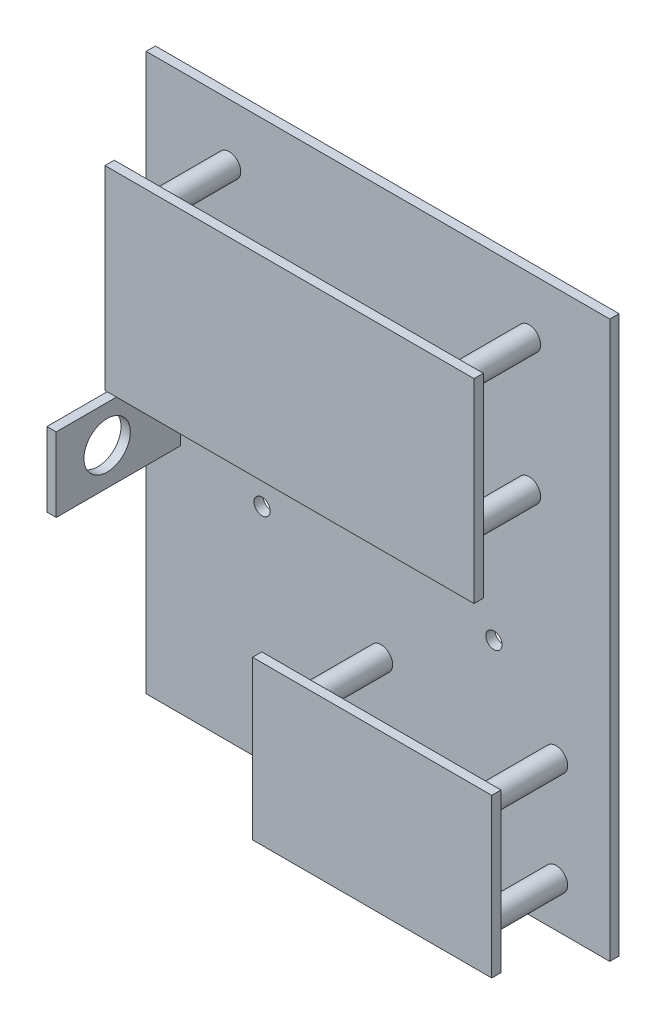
ISO-10303-21;
HEADER;
FILE_DESCRIPTION(('STEP AP214'),'2;1');
FILE_NAME('part.step','',(''),(''),'','','');
FILE_SCHEMA(('AUTOMOTIVE_DESIGN { 1 0 10303 214 1 1 1 1 }'));
ENDSEC;
DATA;
#1=APPLICATION_CONTEXT('core data for automotive mechanical design processes');
#2=APPLICATION_PROTOCOL_DEFINITION('international standard','automotive_design',2000,#1);
#3=PRODUCT_CONTEXT('',#1,'mechanical');
#4=PRODUCT('Part','Part','',(#3));
#5=PRODUCT_RELATED_PRODUCT_CATEGORY('part','',(#4));
#6=PRODUCT_DEFINITION_FORMATION('','',#4);
#7=PRODUCT_DEFINITION_CONTEXT('part definition',#1,'design');
#8=PRODUCT_DEFINITION('design','',#6,#7);
#9=PRODUCT_DEFINITION_SHAPE('','',#8);
#10=(LENGTH_UNIT() NAMED_UNIT(*) SI_UNIT(.MILLI.,.METRE.));
#11=(NAMED_UNIT(*) PLANE_ANGLE_UNIT() SI_UNIT($,.RADIAN.));
#12=(NAMED_UNIT(*) SI_UNIT($,.STERADIAN.) SOLID_ANGLE_UNIT());
#13=UNCERTAINTY_MEASURE_WITH_UNIT(LENGTH_MEASURE(1.E-05),#10,'distance_accuracy_value','');
#14=(GEOMETRIC_REPRESENTATION_CONTEXT(3) GLOBAL_UNCERTAINTY_ASSIGNED_CONTEXT((#13)) GLOBAL_UNIT_ASSIGNED_CONTEXT((#10,
#11,#12)) REPRESENTATION_CONTEXT('',''));
#15=CARTESIAN_POINT('',(0.,0.,0.));
#16=DIRECTION('',(0.,0.,1.));
#17=DIRECTION('',(1.,0.,0.));
#18=AXIS2_PLACEMENT_3D('',#15,#16,#17);
#19=CARTESIAN_POINT('',(0.,120.,2.));
#20=DIRECTION('',(0.,0.,-1.));
#21=DIRECTION('',(-1.,0.,0.));
#22=AXIS2_PLACEMENT_3D('',#19,#20,#21);
#23=PLANE('',#22);
#24=CARTESIAN_POINT('',(25.,72.5,2.));
#25=DIRECTION('',(0.,0.,-1.));
#26=DIRECTION('',(-1.,0.,0.));
#27=AXIS2_PLACEMENT_3D('',#24,#25,#26);
#28=CIRCLE('',#27,1.75);
#29=CARTESIAN_POINT('',(23.25,72.5,2.));
#30=VERTEX_POINT('',#29);
#31=EDGE_CURVE('E811',#30,#30,#28,.T.);
#32=ORIENTED_EDGE('',*,*,#31,.T.);
#33=EDGE_LOOP('',(#32));
#34=FACE_BOUND('',#33,.T.);
#35=CARTESIAN_POINT('',(25.,47.5,2.));
#36=DIRECTION('',(0.,0.,-1.));
#37=DIRECTION('',(-1.,0.,0.));
#38=AXIS2_PLACEMENT_3D('',#35,#36,#37);
#39=CIRCLE('',#38,1.75);
#40=CARTESIAN_POINT('',(23.25,47.5,2.));
#41=VERTEX_POINT('',#40);
#42=EDGE_CURVE('E805',#41,#41,#39,.T.);
#43=ORIENTED_EDGE('',*,*,#42,.T.);
#44=EDGE_LOOP('',(#43));
#45=FACE_BOUND('',#44,.T.);
#46=CARTESIAN_POINT('',(75.,47.5,2.));
#47=DIRECTION('',(0.,0.,-1.));
#48=DIRECTION('',(-1.,0.,0.));
#49=AXIS2_PLACEMENT_3D('',#46,#47,#48);
#50=CIRCLE('',#49,1.75);
#51=CARTESIAN_POINT('',(73.25,47.5,2.));
#52=VERTEX_POINT('',#51);
#53=EDGE_CURVE('E799',#52,#52,#50,.T.);
#54=ORIENTED_EDGE('',*,*,#53,.T.);
#55=EDGE_LOOP('',(#54));
#56=FACE_BOUND('',#55,.T.);
#57=CARTESIAN_POINT('',(75.,72.5,2.));
#58=DIRECTION('',(0.,0.,-1.));
#59=DIRECTION('',(-1.,0.,0.));
#60=AXIS2_PLACEMENT_3D('',#57,#58,#59);
#61=CIRCLE('',#60,1.75);
#62=CARTESIAN_POINT('',(73.25,72.5,2.));
#63=VERTEX_POINT('',#62);
#64=EDGE_CURVE('E791',#63,#63,#61,.T.);
#65=ORIENTED_EDGE('',*,*,#64,.T.);
#66=EDGE_LOOP('',(#65));
#67=FACE_BOUND('',#66,.T.);
#68=DIRECTION('',(0.,-1.,0.));
#69=VECTOR('',#68,1.);
#70=CARTESIAN_POINT('',(0.279042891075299,66.,2.));
#71=LINE('',#70,#69);
#72=CARTESIAN_POINT('',(0.279042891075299,66.,2.));
#73=VERTEX_POINT('',#72);
#74=CARTESIAN_POINT('',(0.279042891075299,50.,2.));
#75=VERTEX_POINT('',#74);
#76=EDGE_CURVE('E54',#73,#75,#71,.T.);
#77=ORIENTED_EDGE('',*,*,#76,.F.);
#78=DIRECTION('',(1.,0.,0.));
#79=VECTOR('',#78,1.);
#80=CARTESIAN_POINT('',(0.279042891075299,66.,2.));
#81=LINE('',#80,#79);
#82=CARTESIAN_POINT('',(7.37780242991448,66.,2.));
#83=VERTEX_POINT('',#82);
#84=EDGE_CURVE('E49',#73,#83,#81,.T.);
#85=ORIENTED_EDGE('',*,*,#84,.T.);
#86=DIRECTION('',(0.,-1.,0.));
#87=VECTOR('',#86,1.);
#88=CARTESIAN_POINT('',(7.37780242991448,66.,2.));
#89=LINE('',#88,#87);
#90=CARTESIAN_POINT('',(7.37780242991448,50.,2.));
#91=VERTEX_POINT('',#90);
#92=EDGE_CURVE('E212',#83,#91,#89,.T.);
#93=ORIENTED_EDGE('',*,*,#92,.T.);
#94=DIRECTION('',(1.,0.,0.));
#95=VECTOR('',#94,1.);
#96=CARTESIAN_POINT('',(0.279042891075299,50.,2.));
#97=LINE('',#96,#95);
#98=EDGE_CURVE('E201',#75,#91,#97,.T.);
#99=ORIENTED_EDGE('',*,*,#98,.F.);
#100=EDGE_LOOP('',(#77,#85,#93,#99));
#101=FACE_BOUND('',#100,.T.);
#102=CARTESIAN_POINT('',(88.4189618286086,9.65936561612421,2.));
#103=DIRECTION('',(0.,0.,-1.));
#104=DIRECTION('',(-1.,0.,0.));
#105=AXIS2_PLACEMENT_3D('',#102,#103,#104);
#106=CIRCLE('',#105,2.5);
#107=CARTESIAN_POINT('',(85.9189618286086,9.65936561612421,2.));
#108=VERTEX_POINT('',#107);
#109=EDGE_CURVE('E42',#108,#108,#106,.F.);
#110=ORIENTED_EDGE('',*,*,#109,.F.);
#111=EDGE_LOOP('',(#110));
#112=FACE_BOUND('',#111,.T.);
#113=CARTESIAN_POINT('',(50.6658867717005,31.9991419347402,2.));
#114=DIRECTION('',(0.,0.,-1.));
#115=DIRECTION('',(-1.,0.,0.));
#116=AXIS2_PLACEMENT_3D('',#113,#114,#115);
#117=CIRCLE('',#116,2.5);
#118=CARTESIAN_POINT('',(48.1658867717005,31.9991419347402,2.));
#119=VERTEX_POINT('',#118);
#120=EDGE_CURVE('E340',#119,#119,#117,.F.);
#121=ORIENTED_EDGE('',*,*,#120,.F.);
#122=EDGE_LOOP('',(#121));
#123=FACE_BOUND('',#122,.T.);
#124=CARTESIAN_POINT('',(82.58484265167,79.3503576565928,2.));
#125=DIRECTION('',(0.,0.,-1.));
#126=DIRECTION('',(-1.,0.,0.));
#127=AXIS2_PLACEMENT_3D('',#124,#125,#126);
#128=CIRCLE('',#127,2.5);
#129=CARTESIAN_POINT('',(80.08484265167,79.3503576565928,2.));
#130=VERTEX_POINT('',#129);
#131=EDGE_CURVE('E334',#130,#130,#128,.F.);
#132=ORIENTED_EDGE('',*,*,#131,.F.);
#133=EDGE_LOOP('',(#132));
#134=FACE_BOUND('',#133,.T.);
#135=CARTESIAN_POINT('',(17.9038666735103,107.720533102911,2.));
#136=DIRECTION('',(0.,0.,-1.));
#137=DIRECTION('',(-1.,0.,0.));
#138=AXIS2_PLACEMENT_3D('',#135,#136,#137);
#139=CIRCLE('',#138,2.5);
#140=CARTESIAN_POINT('',(15.4038666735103,107.720533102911,2.));
#141=VERTEX_POINT('',#140);
#142=EDGE_CURVE('E328',#141,#141,#139,.F.);
#143=ORIENTED_EDGE('',*,*,#142,.F.);
#144=EDGE_LOOP('',(#143));
#145=FACE_BOUND('',#144,.T.);
#146=DIRECTION('',(0.,-1.,0.));
#147=VECTOR('',#146,1.);
#148=CARTESIAN_POINT('',(0.,0.,2.));
#149=LINE('',#148,#147);
#150=CARTESIAN_POINT('',(0.,120.,2.));
#151=VERTEX_POINT('',#150);
#152=CARTESIAN_POINT('',(0.,0.,2.));
#153=VERTEX_POINT('',#152);
#154=EDGE_CURVE('E299',#151,#153,#149,.T.);
#155=ORIENTED_EDGE('',*,*,#154,.T.);
#156=DIRECTION('',(1.,0.,0.));
#157=VECTOR('',#156,1.);
#158=CARTESIAN_POINT('',(0.,0.,2.));
#159=LINE('',#158,#157);
#160=CARTESIAN_POINT('',(100.,0.,2.));
#161=VERTEX_POINT('',#160);
#162=EDGE_CURVE('E302',#153,#161,#159,.T.);
#163=ORIENTED_EDGE('',*,*,#162,.T.);
#164=DIRECTION('',(0.,1.,0.));
#165=VECTOR('',#164,1.);
#166=CARTESIAN_POINT('',(100.,0.,2.));
#167=LINE('',#166,#165);
#168=CARTESIAN_POINT('',(100.,120.,2.));
#169=VERTEX_POINT('',#168);
#170=EDGE_CURVE('E305',#161,#169,#167,.T.);
#171=ORIENTED_EDGE('',*,*,#170,.T.);
#172=DIRECTION('',(-1.,0.,0.));
#173=VECTOR('',#172,1.);
#174=CARTESIAN_POINT('',(0.,120.,2.));
#175=LINE('',#174,#173);
#176=EDGE_CURVE('E307',#169,#151,#175,.T.);
#177=ORIENTED_EDGE('',*,*,#176,.T.);
#178=EDGE_LOOP('',(#155,#163,#171,#177));
#179=FACE_BOUND('',#178,.T.);
#180=CARTESIAN_POINT('',(82.58484265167,107.720533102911,2.));
#181=DIRECTION('',(0.,0.,-1.));
#182=DIRECTION('',(-1.,0.,0.));
#183=AXIS2_PLACEMENT_3D('',#180,#181,#182);
#184=CIRCLE('',#183,2.5);
#185=CARTESIAN_POINT('',(80.08484265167,107.720533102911,2.));
#186=VERTEX_POINT('',#185);
#187=EDGE_CURVE('E331',#186,#186,#184,.F.);
#188=ORIENTED_EDGE('',*,*,#187,.F.);
#189=EDGE_LOOP('',(#188));
#190=FACE_BOUND('',#189,.T.);
#191=CARTESIAN_POINT('',(17.9038666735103,79.3503576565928,2.));
#192=DIRECTION('',(0.,0.,-1.));
#193=DIRECTION('',(-1.,0.,0.));
#194=AXIS2_PLACEMENT_3D('',#191,#192,#193);
#195=CIRCLE('',#194,2.5);
#196=CARTESIAN_POINT('',(15.4038666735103,79.3503576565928,2.));
#197=VERTEX_POINT('',#196);
#198=EDGE_CURVE('E337',#197,#197,#195,.F.);
#199=ORIENTED_EDGE('',*,*,#198,.F.);
#200=EDGE_LOOP('',(#199));
#201=FACE_BOUND('',#200,.T.);
#202=CARTESIAN_POINT('',(88.4189618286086,31.9991419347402,2.));
#203=DIRECTION('',(0.,0.,-1.));
#204=DIRECTION('',(-1.,0.,0.));
#205=AXIS2_PLACEMENT_3D('',#202,#203,#204);
#206=CIRCLE('',#205,2.5);
#207=CARTESIAN_POINT('',(85.9189618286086,31.9991419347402,2.));
#208=VERTEX_POINT('',#207);
#209=EDGE_CURVE('E343',#208,#208,#206,.F.);
#210=ORIENTED_EDGE('',*,*,#209,.F.);
#211=EDGE_LOOP('',(#210));
#212=FACE_BOUND('',#211,.T.);
#213=CARTESIAN_POINT('',(50.6658867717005,9.65936561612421,2.));
#214=DIRECTION('',(0.,0.,-1.));
#215=DIRECTION('',(-1.,0.,0.));
#216=AXIS2_PLACEMENT_3D('',#213,#214,#215);
#217=CIRCLE('',#216,2.5);
#218=CARTESIAN_POINT('',(48.1658867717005,9.65936561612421,2.));
#219=VERTEX_POINT('',#218);
#220=EDGE_CURVE('E11',#219,#219,#217,.F.);
#221=ORIENTED_EDGE('',*,*,#220,.F.);
#222=EDGE_LOOP('',(#221));
#223=FACE_BOUND('',#222,.T.);
#224=ADVANCED_FACE('F33',(#34,#45,#56,#67,#101,#112,#123,#134,#145,#179,#190,#201,#212,#223),
#23,.F.);
#225=CARTESIAN_POINT('',(0.,0.,2.));
#226=DIRECTION('',(1.,0.,0.));
#227=DIRECTION('',(0.,0.,-1.));
#228=AXIS2_PLACEMENT_3D('',#225,#226,#227);
#229=PLANE('',#228);
#230=DIRECTION('',(0.,-1.,0.));
#231=VECTOR('',#230,1.);
#232=CARTESIAN_POINT('',(0.,0.,0.));
#233=LINE('',#232,#231);
#234=CARTESIAN_POINT('',(0.,120.,0.));
#235=VERTEX_POINT('',#234);
#236=CARTESIAN_POINT('',(0.,0.,0.));
#237=VERTEX_POINT('',#236);
#238=EDGE_CURVE('E298',#235,#237,#233,.T.);
#239=ORIENTED_EDGE('',*,*,#238,.T.);
#240=DIRECTION('',(0.,0.,-1.));
#241=VECTOR('',#240,1.);
#242=CARTESIAN_POINT('',(0.,0.,2.));
#243=LINE('',#242,#241);
#244=EDGE_CURVE('E325',#153,#237,#243,.T.);
#245=ORIENTED_EDGE('',*,*,#244,.F.);
#246=ORIENTED_EDGE('',*,*,#154,.F.);
#247=DIRECTION('',(0.,0.,-1.));
#248=VECTOR('',#247,1.);
#249=CARTESIAN_POINT('',(0.,120.,2.));
#250=LINE('',#249,#248);
#251=EDGE_CURVE('E309',#151,#235,#250,.T.);
#252=ORIENTED_EDGE('',*,*,#251,.T.);
#253=EDGE_LOOP('',(#239,#245,#246,#252));
#254=FACE_BOUND('',#253,.T.);
#255=ADVANCED_FACE('F35',(#254),#229,.F.);
#256=CARTESIAN_POINT('',(0.,0.,2.));
#257=DIRECTION('',(0.,1.,0.));
#258=DIRECTION('',(0.,0.,1.));
#259=AXIS2_PLACEMENT_3D('',#256,#257,#258);
#260=PLANE('',#259);
#261=DIRECTION('',(1.,0.,0.));
#262=VECTOR('',#261,1.);
#263=CARTESIAN_POINT('',(0.,0.,0.));
#264=LINE('',#263,#262);
#265=CARTESIAN_POINT('',(100.,0.,0.));
#266=VERTEX_POINT('',#265);
#267=EDGE_CURVE('E312',#237,#266,#264,.T.);
#268=ORIENTED_EDGE('',*,*,#267,.T.);
#269=DIRECTION('',(0.,0.,-1.));
#270=VECTOR('',#269,1.);
#271=CARTESIAN_POINT('',(100.,0.,2.));
#272=LINE('',#271,#270);
#273=EDGE_CURVE('E322',#161,#266,#272,.T.);
#274=ORIENTED_EDGE('',*,*,#273,.F.);
#275=ORIENTED_EDGE('',*,*,#162,.F.);
#276=ORIENTED_EDGE('',*,*,#244,.T.);
#277=EDGE_LOOP('',(#268,#274,#275,#276));
#278=FACE_BOUND('',#277,.T.);
#279=ADVANCED_FACE('F424',(#278),#260,.F.);
#280=CARTESIAN_POINT('',(100.,0.,2.));
#281=DIRECTION('',(-1.,0.,0.));
#282=DIRECTION('',(0.,0.,1.));
#283=AXIS2_PLACEMENT_3D('',#280,#281,#282);
#284=PLANE('',#283);
#285=DIRECTION('',(0.,1.,0.));
#286=VECTOR('',#285,1.);
#287=CARTESIAN_POINT('',(100.,0.,0.));
#288=LINE('',#287,#286);
#289=CARTESIAN_POINT('',(100.,120.,0.));
#290=VERTEX_POINT('',#289);
#291=EDGE_CURVE('E314',#266,#290,#288,.T.);
#292=ORIENTED_EDGE('',*,*,#291,.T.);
#293=DIRECTION('',(0.,0.,-1.));
#294=VECTOR('',#293,1.);
#295=CARTESIAN_POINT('',(100.,120.,2.));
#296=LINE('',#295,#294);
#297=EDGE_CURVE('E319',#169,#290,#296,.T.);
#298=ORIENTED_EDGE('',*,*,#297,.F.);
#299=ORIENTED_EDGE('',*,*,#170,.F.);
#300=ORIENTED_EDGE('',*,*,#273,.T.);
#301=EDGE_LOOP('',(#292,#298,#299,#300));
#302=FACE_BOUND('',#301,.T.);
#303=ADVANCED_FACE('F421',(#302),#284,.F.);
#304=CARTESIAN_POINT('',(0.,120.,2.));
#305=DIRECTION('',(0.,-1.,0.));
#306=DIRECTION('',(0.,0.,-1.));
#307=AXIS2_PLACEMENT_3D('',#304,#305,#306);
#308=PLANE('',#307);
#309=DIRECTION('',(-1.,0.,0.));
#310=VECTOR('',#309,1.);
#311=CARTESIAN_POINT('',(0.,120.,0.));
#312=LINE('',#311,#310);
#313=EDGE_CURVE('E303',#290,#235,#312,.T.);
#314=ORIENTED_EDGE('',*,*,#313,.T.);
#315=ORIENTED_EDGE('',*,*,#251,.F.);
#316=ORIENTED_EDGE('',*,*,#176,.F.);
#317=ORIENTED_EDGE('',*,*,#297,.T.);
#318=EDGE_LOOP('',(#314,#315,#316,#317));
#319=FACE_BOUND('',#318,.T.);
#320=ADVANCED_FACE('F417',(#319),#308,.F.);
#321=CARTESIAN_POINT('',(0.,120.,0.));
#322=DIRECTION('',(0.,0.,-1.));
#323=DIRECTION('',(-1.,0.,0.));
#324=AXIS2_PLACEMENT_3D('',#321,#322,#323);
#325=PLANE('',#324);
#326=CARTESIAN_POINT('',(25.,72.5,0.));
#327=DIRECTION('',(0.,0.,-1.));
#328=DIRECTION('',(-1.,0.,0.));
#329=AXIS2_PLACEMENT_3D('',#326,#327,#328);
#330=CIRCLE('',#329,1.75);
#331=CARTESIAN_POINT('',(23.25,72.5,0.));
#332=VERTEX_POINT('',#331);
#333=EDGE_CURVE('E814',#332,#332,#330,.T.);
#334=ORIENTED_EDGE('',*,*,#333,.F.);
#335=EDGE_LOOP('',(#334));
#336=FACE_BOUND('',#335,.T.);
#337=CARTESIAN_POINT('',(25.,47.5,0.));
#338=DIRECTION('',(0.,0.,-1.));
#339=DIRECTION('',(-1.,0.,0.));
#340=AXIS2_PLACEMENT_3D('',#337,#338,#339);
#341=CIRCLE('',#340,1.75);
#342=CARTESIAN_POINT('',(23.25,47.5,0.));
#343=VERTEX_POINT('',#342);
#344=EDGE_CURVE('E808',#343,#343,#341,.T.);
#345=ORIENTED_EDGE('',*,*,#344,.F.);
#346=EDGE_LOOP('',(#345));
#347=FACE_BOUND('',#346,.T.);
#348=CARTESIAN_POINT('',(75.,47.5,0.));
#349=DIRECTION('',(0.,0.,-1.));
#350=DIRECTION('',(-1.,0.,0.));
#351=AXIS2_PLACEMENT_3D('',#348,#349,#350);
#352=CIRCLE('',#351,1.75);
#353=CARTESIAN_POINT('',(73.25,47.5,0.));
#354=VERTEX_POINT('',#353);
#355=EDGE_CURVE('E802',#354,#354,#352,.T.);
#356=ORIENTED_EDGE('',*,*,#355,.F.);
#357=EDGE_LOOP('',(#356));
#358=FACE_BOUND('',#357,.T.);
#359=CARTESIAN_POINT('',(75.,72.5,0.));
#360=DIRECTION('',(0.,0.,-1.));
#361=DIRECTION('',(-1.,0.,0.));
#362=AXIS2_PLACEMENT_3D('',#359,#360,#361);
#363=CIRCLE('',#362,1.75);
#364=CARTESIAN_POINT('',(73.25,72.5,0.));
#365=VERTEX_POINT('',#364);
#366=EDGE_CURVE('E794',#365,#365,#363,.T.);
#367=ORIENTED_EDGE('',*,*,#366,.F.);
#368=EDGE_LOOP('',(#367));
#369=FACE_BOUND('',#368,.T.);
#370=ORIENTED_EDGE('',*,*,#238,.F.);
#371=ORIENTED_EDGE('',*,*,#313,.F.);
#372=ORIENTED_EDGE('',*,*,#291,.F.);
#373=ORIENTED_EDGE('',*,*,#267,.F.);
#374=EDGE_LOOP('',(#370,#371,#372,#373));
#375=FACE_BOUND('',#374,.T.);
#376=ADVANCED_FACE('F412',(#336,#347,#358,#369,#375),#325,.T.);
#377=CARTESIAN_POINT('',(17.9038666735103,107.720533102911,20.));
#378=DIRECTION('',(0.,0.,-1.));
#379=DIRECTION('',(-1.,0.,0.));
#380=AXIS2_PLACEMENT_3D('',#377,#378,#379);
#381=CYLINDRICAL_SURFACE('',#380,2.5);
#382=CARTESIAN_POINT('',(17.9038666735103,107.720533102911,20.));
#383=DIRECTION('',(0.,0.,1.));
#384=DIRECTION('',(1.,0.,0.));
#385=AXIS2_PLACEMENT_3D('',#382,#383,#384);
#386=CIRCLE('',#385,2.5);
#387=CARTESIAN_POINT('',(20.4038666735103,107.720533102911,20.));
#388=VERTEX_POINT('',#387);
#389=EDGE_CURVE('E295',#388,#388,#386,.T.);
#390=ORIENTED_EDGE('',*,*,#389,.F.);
#391=EDGE_LOOP('',(#390));
#392=FACE_BOUND('',#391,.T.);
#393=ORIENTED_EDGE('',*,*,#142,.T.);
#394=EDGE_LOOP('',(#393));
#395=FACE_BOUND('',#394,.T.);
#396=ADVANCED_FACE('F409',(#392,#395),#381,.T.);
#397=CARTESIAN_POINT('',(82.58484265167,107.720533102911,20.));
#398=DIRECTION('',(0.,0.,-1.));
#399=DIRECTION('',(-1.,0.,0.));
#400=AXIS2_PLACEMENT_3D('',#397,#398,#399);
#401=CYLINDRICAL_SURFACE('',#400,2.5);
#402=CARTESIAN_POINT('',(82.58484265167,107.720533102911,20.));
#403=DIRECTION('',(0.,0.,1.));
#404=DIRECTION('',(1.,0.,0.));
#405=AXIS2_PLACEMENT_3D('',#402,#403,#404);
#406=CIRCLE('',#405,2.5);
#407=CARTESIAN_POINT('',(85.08484265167,107.720533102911,20.));
#408=VERTEX_POINT('',#407);
#409=EDGE_CURVE('E292',#408,#408,#406,.T.);
#410=ORIENTED_EDGE('',*,*,#409,.F.);
#411=EDGE_LOOP('',(#410));
#412=FACE_BOUND('',#411,.T.);
#413=ORIENTED_EDGE('',*,*,#187,.T.);
#414=EDGE_LOOP('',(#413));
#415=FACE_BOUND('',#414,.T.);
#416=ADVANCED_FACE('F405',(#412,#415),#401,.T.);
#417=CARTESIAN_POINT('',(82.58484265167,79.3503576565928,20.));
#418=DIRECTION('',(0.,0.,-1.));
#419=DIRECTION('',(-1.,0.,0.));
#420=AXIS2_PLACEMENT_3D('',#417,#418,#419);
#421=CYLINDRICAL_SURFACE('',#420,2.5);
#422=CARTESIAN_POINT('',(82.58484265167,79.3503576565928,20.));
#423=DIRECTION('',(0.,0.,1.));
#424=DIRECTION('',(1.,0.,0.));
#425=AXIS2_PLACEMENT_3D('',#422,#423,#424);
#426=CIRCLE('',#425,2.5);
#427=CARTESIAN_POINT('',(85.08484265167,79.3503576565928,20.));
#428=VERTEX_POINT('',#427);
#429=EDGE_CURVE('E289',#428,#428,#426,.T.);
#430=ORIENTED_EDGE('',*,*,#429,.F.);
#431=EDGE_LOOP('',(#430));
#432=FACE_BOUND('',#431,.T.);
#433=ORIENTED_EDGE('',*,*,#131,.T.);
#434=EDGE_LOOP('',(#433));
#435=FACE_BOUND('',#434,.T.);
#436=ADVANCED_FACE('F401',(#432,#435),#421,.T.);
#437=CARTESIAN_POINT('',(17.9038666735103,79.3503576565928,20.));
#438=DIRECTION('',(0.,0.,-1.));
#439=DIRECTION('',(-1.,0.,0.));
#440=AXIS2_PLACEMENT_3D('',#437,#438,#439);
#441=CYLINDRICAL_SURFACE('',#440,2.5);
#442=CARTESIAN_POINT('',(17.9038666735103,79.3503576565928,20.));
#443=DIRECTION('',(0.,0.,1.));
#444=DIRECTION('',(1.,0.,0.));
#445=AXIS2_PLACEMENT_3D('',#442,#443,#444);
#446=CIRCLE('',#445,2.5);
#447=CARTESIAN_POINT('',(20.4038666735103,79.3503576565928,20.));
#448=VERTEX_POINT('',#447);
#449=EDGE_CURVE('E286',#448,#448,#446,.T.);
#450=ORIENTED_EDGE('',*,*,#449,.F.);
#451=EDGE_LOOP('',(#450));
#452=FACE_BOUND('',#451,.T.);
#453=ORIENTED_EDGE('',*,*,#198,.T.);
#454=EDGE_LOOP('',(#453));
#455=FACE_BOUND('',#454,.T.);
#456=ADVANCED_FACE('F397',(#452,#455),#441,.T.);
#457=CARTESIAN_POINT('',(50.6658867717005,31.9991419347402,20.));
#458=DIRECTION('',(0.,0.,-1.));
#459=DIRECTION('',(-1.,0.,0.));
#460=AXIS2_PLACEMENT_3D('',#457,#458,#459);
#461=CYLINDRICAL_SURFACE('',#460,2.5);
#462=CARTESIAN_POINT('',(50.6658867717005,31.9991419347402,20.));
#463=DIRECTION('',(0.,0.,1.));
#464=DIRECTION('',(1.,0.,0.));
#465=AXIS2_PLACEMENT_3D('',#462,#463,#464);
#466=CIRCLE('',#465,2.5);
#467=CARTESIAN_POINT('',(53.1658867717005,31.9991419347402,20.));
#468=VERTEX_POINT('',#467);
#469=EDGE_CURVE('E283',#468,#468,#466,.T.);
#470=ORIENTED_EDGE('',*,*,#469,.F.);
#471=EDGE_LOOP('',(#470));
#472=FACE_BOUND('',#471,.T.);
#473=ORIENTED_EDGE('',*,*,#120,.T.);
#474=EDGE_LOOP('',(#473));
#475=FACE_BOUND('',#474,.T.);
#476=ADVANCED_FACE('F393',(#472,#475),#461,.T.);
#477=CARTESIAN_POINT('',(88.4189618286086,31.9991419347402,20.));
#478=DIRECTION('',(0.,0.,-1.));
#479=DIRECTION('',(-1.,0.,0.));
#480=AXIS2_PLACEMENT_3D('',#477,#478,#479);
#481=CYLINDRICAL_SURFACE('',#480,2.5);
#482=CARTESIAN_POINT('',(88.4189618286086,31.9991419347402,20.));
#483=DIRECTION('',(0.,0.,1.));
#484=DIRECTION('',(1.,0.,0.));
#485=AXIS2_PLACEMENT_3D('',#482,#483,#484);
#486=CIRCLE('',#485,2.5);
#487=CARTESIAN_POINT('',(90.9189618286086,31.9991419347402,20.));
#488=VERTEX_POINT('',#487);
#489=EDGE_CURVE('E280',#488,#488,#486,.T.);
#490=ORIENTED_EDGE('',*,*,#489,.F.);
#491=EDGE_LOOP('',(#490));
#492=FACE_BOUND('',#491,.T.);
#493=ORIENTED_EDGE('',*,*,#209,.T.);
#494=EDGE_LOOP('',(#493));
#495=FACE_BOUND('',#494,.T.);
#496=ADVANCED_FACE('F384',(#492,#495),#481,.T.);
#497=CARTESIAN_POINT('',(88.4189618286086,9.65936561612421,20.));
#498=DIRECTION('',(0.,0.,-1.));
#499=DIRECTION('',(-1.,0.,0.));
#500=AXIS2_PLACEMENT_3D('',#497,#498,#499);
#501=CYLINDRICAL_SURFACE('',#500,2.5);
#502=CARTESIAN_POINT('',(88.4189618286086,9.65936561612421,20.));
#503=DIRECTION('',(0.,0.,1.));
#504=DIRECTION('',(1.,0.,0.));
#505=AXIS2_PLACEMENT_3D('',#502,#503,#504);
#506=CIRCLE('',#505,2.5);
#507=CARTESIAN_POINT('',(90.9189618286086,9.65936561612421,20.));
#508=VERTEX_POINT('',#507);
#509=EDGE_CURVE('E277',#508,#508,#506,.T.);
#510=ORIENTED_EDGE('',*,*,#509,.F.);
#511=EDGE_LOOP('',(#510));
#512=FACE_BOUND('',#511,.T.);
#513=ORIENTED_EDGE('',*,*,#109,.T.);
#514=EDGE_LOOP('',(#513));
#515=FACE_BOUND('',#514,.T.);
#516=ADVANCED_FACE('F349',(#512,#515),#501,.T.);
#517=CARTESIAN_POINT('',(50.6658867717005,9.65936561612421,20.));
#518=DIRECTION('',(0.,0.,-1.));
#519=DIRECTION('',(-1.,0.,0.));
#520=AXIS2_PLACEMENT_3D('',#517,#518,#519);
#521=CYLINDRICAL_SURFACE('',#520,2.5);
#522=CARTESIAN_POINT('',(50.6658867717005,9.65936561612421,20.));
#523=DIRECTION('',(0.,0.,1.));
#524=DIRECTION('',(1.,0.,0.));
#525=AXIS2_PLACEMENT_3D('',#522,#523,#524);
#526=CIRCLE('',#525,2.5);
#527=CARTESIAN_POINT('',(53.1658867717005,9.65936561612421,20.));
#528=VERTEX_POINT('',#527);
#529=EDGE_CURVE('E274',#528,#528,#526,.T.);
#530=ORIENTED_EDGE('',*,*,#529,.F.);
#531=EDGE_LOOP('',(#530));
#532=FACE_BOUND('',#531,.T.);
#533=ORIENTED_EDGE('',*,*,#220,.T.);
#534=EDGE_LOOP('',(#533));
#535=FACE_BOUND('',#534,.T.);
#536=ADVANCED_FACE('F372',(#532,#535),#521,.T.);
#537=CARTESIAN_POINT('',(11.1200612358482,72.2186647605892,20.));
#538=DIRECTION('',(0.,0.,1.));
#539=DIRECTION('',(1.,0.,0.));
#540=AXIS2_PLACEMENT_3D('',#537,#538,#539);
#541=PLANE('',#540);
#542=ORIENTED_EDGE('',*,*,#409,.T.);
#543=EDGE_LOOP('',(#542));
#544=FACE_BOUND('',#543,.T.);
#545=ORIENTED_EDGE('',*,*,#449,.T.);
#546=EDGE_LOOP('',(#545));
#547=FACE_BOUND('',#546,.T.);
#548=DIRECTION('',(0.,-1.,0.));
#549=VECTOR('',#548,1.);
#550=CARTESIAN_POINT('',(11.1200612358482,114.231487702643,20.));
#551=LINE('',#550,#549);
#552=CARTESIAN_POINT('',(11.1200612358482,114.231487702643,20.));
#553=VERTEX_POINT('',#552);
#554=CARTESIAN_POINT('',(11.1200612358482,72.2186647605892,20.));
#555=VERTEX_POINT('',#554);
#556=EDGE_CURVE('E244',#553,#555,#551,.T.);
#557=ORIENTED_EDGE('',*,*,#556,.F.);
#558=DIRECTION('',(-1.,0.,0.));
#559=VECTOR('',#558,1.);
#560=CARTESIAN_POINT('',(11.1200612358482,114.231487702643,20.));
#561=LINE('',#560,#559);
#562=CARTESIAN_POINT('',(90.7255307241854,114.231487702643,20.));
#563=VERTEX_POINT('',#562);
#564=EDGE_CURVE('E249',#563,#553,#561,.T.);
#565=ORIENTED_EDGE('',*,*,#564,.F.);
#566=DIRECTION('',(0.,1.,0.));
#567=VECTOR('',#566,1.);
#568=CARTESIAN_POINT('',(90.7255307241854,114.231487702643,20.));
#569=LINE('',#568,#567);
#570=CARTESIAN_POINT('',(90.7255307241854,72.2186647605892,20.));
#571=VERTEX_POINT('',#570);
#572=EDGE_CURVE('E260',#571,#563,#569,.T.);
#573=ORIENTED_EDGE('',*,*,#572,.F.);
#574=DIRECTION('',(1.,0.,0.));
#575=VECTOR('',#574,1.);
#576=CARTESIAN_POINT('',(11.1200612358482,72.2186647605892,20.));
#577=LINE('',#576,#575);
#578=EDGE_CURVE('E258',#555,#571,#577,.T.);
#579=ORIENTED_EDGE('',*,*,#578,.F.);
#580=EDGE_LOOP('',(#557,#565,#573,#579));
#581=FACE_BOUND('',#580,.T.);
#582=ORIENTED_EDGE('',*,*,#429,.T.);
#583=EDGE_LOOP('',(#582));
#584=FACE_BOUND('',#583,.T.);
#585=ORIENTED_EDGE('',*,*,#389,.T.);
#586=EDGE_LOOP('',(#585));
#587=FACE_BOUND('',#586,.T.);
#588=ADVANCED_FACE('F374',(#544,#547,#581,#584,#587),#541,.F.);
#589=CARTESIAN_POINT('',(11.1200612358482,114.231487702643,22.));
#590=DIRECTION('',(1.,0.,0.));
#591=DIRECTION('',(0.,1.,0.));
#592=AXIS2_PLACEMENT_3D('',#589,#590,#591);
#593=PLANE('',#592);
#594=ORIENTED_EDGE('',*,*,#556,.T.);
#595=DIRECTION('',(0.,0.,-1.));
#596=VECTOR('',#595,1.);
#597=CARTESIAN_POINT('',(11.1200612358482,72.2186647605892,22.));
#598=LINE('',#597,#596);
#599=CARTESIAN_POINT('',(11.1200612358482,72.2186647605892,22.));
#600=VERTEX_POINT('',#599);
#601=EDGE_CURVE('E271',#600,#555,#598,.T.);
#602=ORIENTED_EDGE('',*,*,#601,.F.);
#603=DIRECTION('',(0.,-1.,0.));
#604=VECTOR('',#603,1.);
#605=CARTESIAN_POINT('',(11.1200612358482,114.231487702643,22.));
#606=LINE('',#605,#604);
#607=CARTESIAN_POINT('',(11.1200612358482,114.231487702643,22.));
#608=VERTEX_POINT('',#607);
#609=EDGE_CURVE('E245',#608,#600,#606,.T.);
#610=ORIENTED_EDGE('',*,*,#609,.F.);
#611=DIRECTION('',(0.,0.,-1.));
#612=VECTOR('',#611,1.);
#613=CARTESIAN_POINT('',(11.1200612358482,114.231487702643,22.));
#614=LINE('',#613,#612);
#615=EDGE_CURVE('E255',#608,#553,#614,.T.);
#616=ORIENTED_EDGE('',*,*,#615,.T.);
#617=EDGE_LOOP('',(#594,#602,#610,#616));
#618=FACE_BOUND('',#617,.T.);
#619=ADVANCED_FACE('F381',(#618),#593,.F.);
#620=CARTESIAN_POINT('',(11.1200612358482,72.2186647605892,22.));
#621=DIRECTION('',(0.,1.,0.));
#622=DIRECTION('',(0.,0.,1.));
#623=AXIS2_PLACEMENT_3D('',#620,#621,#622);
#624=PLANE('',#623);
#625=ORIENTED_EDGE('',*,*,#578,.T.);
#626=DIRECTION('',(0.,0.,-1.));
#627=VECTOR('',#626,1.);
#628=CARTESIAN_POINT('',(90.7255307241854,72.2186647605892,22.));
#629=LINE('',#628,#627);
#630=CARTESIAN_POINT('',(90.7255307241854,72.2186647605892,22.));
#631=VERTEX_POINT('',#630);
#632=EDGE_CURVE('E268',#631,#571,#629,.T.);
#633=ORIENTED_EDGE('',*,*,#632,.F.);
#634=DIRECTION('',(1.,0.,0.));
#635=VECTOR('',#634,1.);
#636=CARTESIAN_POINT('',(11.1200612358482,72.2186647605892,22.));
#637=LINE('',#636,#635);
#638=EDGE_CURVE('E248',#600,#631,#637,.T.);
#639=ORIENTED_EDGE('',*,*,#638,.F.);
#640=ORIENTED_EDGE('',*,*,#601,.T.);
#641=EDGE_LOOP('',(#625,#633,#639,#640));
#642=FACE_BOUND('',#641,.T.);
#643=ADVANCED_FACE('F567',(#642),#624,.F.);
#644=CARTESIAN_POINT('',(90.7255307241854,114.231487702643,22.));
#645=DIRECTION('',(-1.,0.,0.));
#646=DIRECTION('',(0.,0.,1.));
#647=AXIS2_PLACEMENT_3D('',#644,#645,#646);
#648=PLANE('',#647);
#649=ORIENTED_EDGE('',*,*,#572,.T.);
#650=DIRECTION('',(0.,0.,-1.));
#651=VECTOR('',#650,1.);
#652=CARTESIAN_POINT('',(90.7255307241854,114.231487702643,22.));
#653=LINE('',#652,#651);
#654=CARTESIAN_POINT('',(90.7255307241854,114.231487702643,22.));
#655=VERTEX_POINT('',#654);
#656=EDGE_CURVE('E265',#655,#563,#653,.T.);
#657=ORIENTED_EDGE('',*,*,#656,.F.);
#658=DIRECTION('',(0.,1.,0.));
#659=VECTOR('',#658,1.);
#660=CARTESIAN_POINT('',(90.7255307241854,114.231487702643,22.));
#661=LINE('',#660,#659);
#662=EDGE_CURVE('E251',#631,#655,#661,.T.);
#663=ORIENTED_EDGE('',*,*,#662,.F.);
#664=ORIENTED_EDGE('',*,*,#632,.T.);
#665=EDGE_LOOP('',(#649,#657,#663,#664));
#666=FACE_BOUND('',#665,.T.);
#667=ADVANCED_FACE('F564',(#666),#648,.F.);
#668=CARTESIAN_POINT('',(11.1200612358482,114.231487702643,22.));
#669=DIRECTION('',(0.,-1.,0.));
#670=DIRECTION('',(0.,0.,-1.));
#671=AXIS2_PLACEMENT_3D('',#668,#669,#670);
#672=PLANE('',#671);
#673=ORIENTED_EDGE('',*,*,#564,.T.);
#674=ORIENTED_EDGE('',*,*,#615,.F.);
#675=DIRECTION('',(-1.,0.,0.));
#676=VECTOR('',#675,1.);
#677=CARTESIAN_POINT('',(11.1200612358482,114.231487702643,22.));
#678=LINE('',#677,#676);
#679=EDGE_CURVE('E253',#655,#608,#678,.T.);
#680=ORIENTED_EDGE('',*,*,#679,.F.);
#681=ORIENTED_EDGE('',*,*,#656,.T.);
#682=EDGE_LOOP('',(#673,#674,#680,#681));
#683=FACE_BOUND('',#682,.T.);
#684=ADVANCED_FACE('F559',(#683),#672,.F.);
#685=CARTESIAN_POINT('',(11.1200612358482,72.2186647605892,22.));
#686=DIRECTION('',(0.,0.,1.));
#687=DIRECTION('',(1.,0.,0.));
#688=AXIS2_PLACEMENT_3D('',#685,#686,#687);
#689=PLANE('',#688);
#690=ORIENTED_EDGE('',*,*,#609,.T.);
#691=ORIENTED_EDGE('',*,*,#638,.T.);
#692=ORIENTED_EDGE('',*,*,#662,.T.);
#693=ORIENTED_EDGE('',*,*,#679,.T.);
#694=EDGE_LOOP('',(#690,#691,#692,#693));
#695=FACE_BOUND('',#694,.T.);
#696=ADVANCED_FACE('F542',(#695),#689,.T.);
#697=CARTESIAN_POINT('',(42.9517636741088,4.1759659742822,20.));
#698=DIRECTION('',(0.,0.,1.));
#699=DIRECTION('',(1.,0.,0.));
#700=AXIS2_PLACEMENT_3D('',#697,#698,#699);
#701=PLANE('',#700);
#702=ORIENTED_EDGE('',*,*,#489,.T.);
#703=EDGE_LOOP('',(#702));
#704=FACE_BOUND('',#703,.T.);
#705=ORIENTED_EDGE('',*,*,#529,.T.);
#706=EDGE_LOOP('',(#705));
#707=FACE_BOUND('',#706,.T.);
#708=DIRECTION('',(0.,-1.,0.));
#709=VECTOR('',#708,1.);
#710=CARTESIAN_POINT('',(42.9517636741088,38.2996375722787,20.));
#711=LINE('',#710,#709);
#712=CARTESIAN_POINT('',(42.9517636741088,38.2996375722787,20.));
#713=VERTEX_POINT('',#712);
#714=CARTESIAN_POINT('',(42.9517636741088,4.1759659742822,20.));
#715=VERTEX_POINT('',#714);
#716=EDGE_CURVE('E180',#713,#715,#711,.T.);
#717=ORIENTED_EDGE('',*,*,#716,.F.);
#718=DIRECTION('',(-1.,0.,0.));
#719=VECTOR('',#718,1.);
#720=CARTESIAN_POINT('',(42.9517636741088,38.2996375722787,20.));
#721=LINE('',#720,#719);
#722=CARTESIAN_POINT('',(94.5374315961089,38.2996375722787,20.));
#723=VERTEX_POINT('',#722);
#724=EDGE_CURVE('E219',#723,#713,#721,.T.);
#725=ORIENTED_EDGE('',*,*,#724,.F.);
#726=DIRECTION('',(0.,1.,0.));
#727=VECTOR('',#726,1.);
#728=CARTESIAN_POINT('',(94.5374315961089,38.2996375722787,20.));
#729=LINE('',#728,#727);
#730=CARTESIAN_POINT('',(94.5374315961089,4.1759659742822,20.));
#731=VERTEX_POINT('',#730);
#732=EDGE_CURVE('E230',#731,#723,#729,.T.);
#733=ORIENTED_EDGE('',*,*,#732,.F.);
#734=DIRECTION('',(1.,0.,0.));
#735=VECTOR('',#734,1.);
#736=CARTESIAN_POINT('',(42.9517636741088,4.1759659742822,20.));
#737=LINE('',#736,#735);
#738=EDGE_CURVE('E228',#715,#731,#737,.T.);
#739=ORIENTED_EDGE('',*,*,#738,.F.);
#740=EDGE_LOOP('',(#717,#725,#733,#739));
#741=FACE_BOUND('',#740,.T.);
#742=ORIENTED_EDGE('',*,*,#509,.T.);
#743=EDGE_LOOP('',(#742));
#744=FACE_BOUND('',#743,.T.);
#745=ORIENTED_EDGE('',*,*,#469,.T.);
#746=EDGE_LOOP('',(#745));
#747=FACE_BOUND('',#746,.T.);
#748=ADVANCED_FACE('F538',(#704,#707,#741,#744,#747),#701,.F.);
#749=CARTESIAN_POINT('',(42.9517636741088,38.2996375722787,22.));
#750=DIRECTION('',(1.,0.,0.));
#751=DIRECTION('',(0.,1.,0.));
#752=AXIS2_PLACEMENT_3D('',#749,#750,#751);
#753=PLANE('',#752);
#754=ORIENTED_EDGE('',*,*,#716,.T.);
#755=DIRECTION('',(0.,0.,-1.));
#756=VECTOR('',#755,1.);
#757=CARTESIAN_POINT('',(42.9517636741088,4.1759659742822,22.));
#758=LINE('',#757,#756);
#759=CARTESIAN_POINT('',(42.9517636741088,4.1759659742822,22.));
#760=VERTEX_POINT('',#759);
#761=EDGE_CURVE('E241',#760,#715,#758,.T.);
#762=ORIENTED_EDGE('',*,*,#761,.F.);
#763=DIRECTION('',(0.,-1.,0.));
#764=VECTOR('',#763,1.);
#765=CARTESIAN_POINT('',(42.9517636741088,38.2996375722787,22.));
#766=LINE('',#765,#764);
#767=CARTESIAN_POINT('',(42.9517636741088,38.2996375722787,22.));
#768=VERTEX_POINT('',#767);
#769=EDGE_CURVE('E215',#768,#760,#766,.T.);
#770=ORIENTED_EDGE('',*,*,#769,.F.);
#771=DIRECTION('',(0.,0.,-1.));
#772=VECTOR('',#771,1.);
#773=CARTESIAN_POINT('',(42.9517636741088,38.2996375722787,22.));
#774=LINE('',#773,#772);
#775=EDGE_CURVE('E225',#768,#713,#774,.T.);
#776=ORIENTED_EDGE('',*,*,#775,.T.);
#777=EDGE_LOOP('',(#754,#762,#770,#776));
#778=FACE_BOUND('',#777,.T.);
#779=ADVANCED_FACE('F541',(#778),#753,.F.);
#780=CARTESIAN_POINT('',(42.9517636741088,4.1759659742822,22.));
#781=DIRECTION('',(0.,1.,0.));
#782=DIRECTION('',(0.,0.,1.));
#783=AXIS2_PLACEMENT_3D('',#780,#781,#782);
#784=PLANE('',#783);
#785=ORIENTED_EDGE('',*,*,#738,.T.);
#786=DIRECTION('',(0.,0.,-1.));
#787=VECTOR('',#786,1.);
#788=CARTESIAN_POINT('',(94.5374315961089,4.1759659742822,22.));
#789=LINE('',#788,#787);
#790=CARTESIAN_POINT('',(94.5374315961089,4.1759659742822,22.));
#791=VERTEX_POINT('',#790);
#792=EDGE_CURVE('E238',#791,#731,#789,.T.);
#793=ORIENTED_EDGE('',*,*,#792,.F.);
#794=DIRECTION('',(1.,0.,0.));
#795=VECTOR('',#794,1.);
#796=CARTESIAN_POINT('',(42.9517636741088,4.1759659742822,22.));
#797=LINE('',#796,#795);
#798=EDGE_CURVE('E218',#760,#791,#797,.T.);
#799=ORIENTED_EDGE('',*,*,#798,.F.);
#800=ORIENTED_EDGE('',*,*,#761,.T.);
#801=EDGE_LOOP('',(#785,#793,#799,#800));
#802=FACE_BOUND('',#801,.T.);
#803=ADVANCED_FACE('F550',(#802),#784,.F.);
#804=CARTESIAN_POINT('',(94.5374315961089,38.2996375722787,22.));
#805=DIRECTION('',(-1.,0.,0.));
#806=DIRECTION('',(0.,0.,1.));
#807=AXIS2_PLACEMENT_3D('',#804,#805,#806);
#808=PLANE('',#807);
#809=ORIENTED_EDGE('',*,*,#732,.T.);
#810=DIRECTION('',(0.,0.,-1.));
#811=VECTOR('',#810,1.);
#812=CARTESIAN_POINT('',(94.5374315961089,38.2996375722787,22.));
#813=LINE('',#812,#811);
#814=CARTESIAN_POINT('',(94.5374315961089,38.2996375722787,22.));
#815=VERTEX_POINT('',#814);
#816=EDGE_CURVE('E235',#815,#723,#813,.T.);
#817=ORIENTED_EDGE('',*,*,#816,.F.);
#818=DIRECTION('',(0.,1.,0.));
#819=VECTOR('',#818,1.);
#820=CARTESIAN_POINT('',(94.5374315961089,38.2996375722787,22.));
#821=LINE('',#820,#819);
#822=EDGE_CURVE('E221',#791,#815,#821,.T.);
#823=ORIENTED_EDGE('',*,*,#822,.F.);
#824=ORIENTED_EDGE('',*,*,#792,.T.);
#825=EDGE_LOOP('',(#809,#817,#823,#824));
#826=FACE_BOUND('',#825,.T.);
#827=ADVANCED_FACE('F546',(#826),#808,.F.);
#828=CARTESIAN_POINT('',(42.9517636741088,38.2996375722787,22.));
#829=DIRECTION('',(0.,-1.,0.));
#830=DIRECTION('',(0.,0.,-1.));
#831=AXIS2_PLACEMENT_3D('',#828,#829,#830);
#832=PLANE('',#831);
#833=ORIENTED_EDGE('',*,*,#724,.T.);
#834=ORIENTED_EDGE('',*,*,#775,.F.);
#835=DIRECTION('',(-1.,0.,0.));
#836=VECTOR('',#835,1.);
#837=CARTESIAN_POINT('',(42.9517636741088,38.2996375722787,22.));
#838=LINE('',#837,#836);
#839=EDGE_CURVE('E223',#815,#768,#838,.T.);
#840=ORIENTED_EDGE('',*,*,#839,.F.);
#841=ORIENTED_EDGE('',*,*,#816,.T.);
#842=EDGE_LOOP('',(#833,#834,#840,#841));
#843=FACE_BOUND('',#842,.T.);
#844=ADVANCED_FACE('F536',(#843),#832,.F.);
#845=CARTESIAN_POINT('',(42.9517636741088,4.1759659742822,22.));
#846=DIRECTION('',(0.,0.,1.));
#847=DIRECTION('',(1.,0.,0.));
#848=AXIS2_PLACEMENT_3D('',#845,#846,#847);
#849=PLANE('',#848);
#850=ORIENTED_EDGE('',*,*,#769,.T.);
#851=ORIENTED_EDGE('',*,*,#798,.T.);
#852=ORIENTED_EDGE('',*,*,#822,.T.);
#853=ORIENTED_EDGE('',*,*,#839,.T.);
#854=EDGE_LOOP('',(#850,#851,#852,#853));
#855=FACE_BOUND('',#854,.T.);
#856=ADVANCED_FACE('F532',(#855),#849,.T.);
#857=CARTESIAN_POINT('',(5.37780242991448,66.,2.));
#858=DIRECTION('',(1.,0.,0.));
#859=DIRECTION('',(0.,0.,-1.));
#860=AXIS2_PLACEMENT_3D('',#857,#858,#859);
#861=PLANE('',#860);
#862=CARTESIAN_POINT('',(5.37780242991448,58.,17.7999524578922));
#863=DIRECTION('',(-1.,0.,0.));
#864=DIRECTION('',(0.,0.,1.));
#865=AXIS2_PLACEMENT_3D('',#862,#863,#864);
#866=CIRCLE('',#865,5.);
#867=CARTESIAN_POINT('',(5.37780242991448,58.,22.7999524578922));
#868=VERTEX_POINT('',#867);
#869=EDGE_CURVE('E789',#868,#868,#866,.T.);
#870=ORIENTED_EDGE('',*,*,#869,.F.);
#871=EDGE_LOOP('',(#870));
#872=FACE_BOUND('',#871,.T.);
#873=DIRECTION('',(0.,0.,-1.));
#874=VECTOR('',#873,1.);
#875=CARTESIAN_POINT('',(5.37780242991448,50.,2.));
#876=LINE('',#875,#874);
#877=CARTESIAN_POINT('',(5.37780242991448,50.,4.));
#878=VERTEX_POINT('',#877);
#879=CARTESIAN_POINT('',(5.37780242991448,50.,28.776459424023));
#880=VERTEX_POINT('',#879);
#881=EDGE_CURVE('E176',#878,#880,#876,.F.);
#882=ORIENTED_EDGE('',*,*,#881,.T.);
#883=DIRECTION('',(0.,-1.,0.));
#884=VECTOR('',#883,1.);
#885=CARTESIAN_POINT('',(5.37780242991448,66.,28.776459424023));
#886=LINE('',#885,#884);
#887=CARTESIAN_POINT('',(5.37780242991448,66.,28.776459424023));
#888=VERTEX_POINT('',#887);
#889=EDGE_CURVE('E173',#888,#880,#886,.T.);
#890=ORIENTED_EDGE('',*,*,#889,.F.);
#891=DIRECTION('',(0.,0.,-1.));
#892=VECTOR('',#891,1.);
#893=CARTESIAN_POINT('',(5.37780242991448,66.,2.));
#894=LINE('',#893,#892);
#895=CARTESIAN_POINT('',(5.37780242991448,66.,4.));
#896=VERTEX_POINT('',#895);
#897=EDGE_CURVE('E157',#896,#888,#894,.F.);
#898=ORIENTED_EDGE('',*,*,#897,.F.);
#899=DIRECTION('',(0.,-1.,0.));
#900=VECTOR('',#899,1.);
#901=CARTESIAN_POINT('',(5.37780242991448,66.,4.));
#902=LINE('',#901,#900);
#903=EDGE_CURVE('E194',#896,#878,#902,.T.);
#904=ORIENTED_EDGE('',*,*,#903,.T.);
#905=EDGE_LOOP('',(#882,#890,#898,#904));
#906=FACE_BOUND('',#905,.T.);
#907=ADVANCED_FACE('F174',(#872,#906),#861,.F.);
#908=CARTESIAN_POINT('',(7.37780242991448,66.,28.776459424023));
#909=DIRECTION('',(0.,0.,1.));
#910=DIRECTION('',(1.,0.,0.));
#911=AXIS2_PLACEMENT_3D('',#908,#909,#910);
#912=PLANE('',#911);
#913=DIRECTION('',(-1.,0.,0.));
#914=VECTOR('',#913,1.);
#915=CARTESIAN_POINT('',(7.37780242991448,50.,28.776459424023));
#916=LINE('',#915,#914);
#917=CARTESIAN_POINT('',(7.37780242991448,50.,28.776459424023));
#918=VERTEX_POINT('',#917);
#919=EDGE_CURVE('E196',#918,#880,#916,.T.);
#920=ORIENTED_EDGE('',*,*,#919,.F.);
#921=DIRECTION('',(0.,-1.,0.));
#922=VECTOR('',#921,1.);
#923=CARTESIAN_POINT('',(7.37780242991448,66.,28.776459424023));
#924=LINE('',#923,#922);
#925=CARTESIAN_POINT('',(7.37780242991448,66.,28.776459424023));
#926=VERTEX_POINT('',#925);
#927=EDGE_CURVE('E181',#926,#918,#924,.T.);
#928=ORIENTED_EDGE('',*,*,#927,.F.);
#929=DIRECTION('',(-1.,0.,0.));
#930=VECTOR('',#929,1.);
#931=CARTESIAN_POINT('',(7.37780242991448,66.,28.776459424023));
#932=LINE('',#931,#930);
#933=EDGE_CURVE('E162',#926,#888,#932,.T.);
#934=ORIENTED_EDGE('',*,*,#933,.T.);
#935=ORIENTED_EDGE('',*,*,#889,.T.);
#936=EDGE_LOOP('',(#920,#928,#934,#935));
#937=FACE_BOUND('',#936,.T.);
#938=ADVANCED_FACE('F183',(#937),#912,.T.);
#939=CARTESIAN_POINT('',(7.37780242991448,66.,2.));
#940=DIRECTION('',(1.,0.,0.));
#941=DIRECTION('',(0.,0.,-1.));
#942=AXIS2_PLACEMENT_3D('',#939,#940,#941);
#943=PLANE('',#942);
#944=CARTESIAN_POINT('',(7.37780242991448,58.,17.7999524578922));
#945=DIRECTION('',(1.,0.,0.));
#946=DIRECTION('',(0.,0.,-1.));
#947=AXIS2_PLACEMENT_3D('',#944,#945,#946);
#948=CIRCLE('',#947,5.);
#949=CARTESIAN_POINT('',(7.37780242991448,58.,12.7999524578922));
#950=VERTEX_POINT('',#949);
#951=EDGE_CURVE('E37',#950,#950,#948,.T.);
#952=ORIENTED_EDGE('',*,*,#951,.F.);
#953=EDGE_LOOP('',(#952));
#954=FACE_BOUND('',#953,.T.);
#955=DIRECTION('',(0.,0.,1.));
#956=VECTOR('',#955,1.);
#957=CARTESIAN_POINT('',(7.37780242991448,50.,2.));
#958=LINE('',#957,#956);
#959=EDGE_CURVE('E198',#91,#918,#958,.T.);
#960=ORIENTED_EDGE('',*,*,#959,.F.);
#961=ORIENTED_EDGE('',*,*,#92,.F.);
#962=DIRECTION('',(0.,0.,1.));
#963=VECTOR('',#962,1.);
#964=CARTESIAN_POINT('',(7.37780242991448,66.,2.));
#965=LINE('',#964,#963);
#966=EDGE_CURVE('E184',#83,#926,#965,.T.);
#967=ORIENTED_EDGE('',*,*,#966,.T.);
#968=ORIENTED_EDGE('',*,*,#927,.T.);
#969=EDGE_LOOP('',(#960,#961,#967,#968));
#970=FACE_BOUND('',#969,.T.);
#971=ADVANCED_FACE('F523',(#954,#970),#943,.T.);
#972=CARTESIAN_POINT('',(0.279042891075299,66.,4.));
#973=DIRECTION('',(-1.,0.,0.));
#974=DIRECTION('',(0.,0.,1.));
#975=AXIS2_PLACEMENT_3D('',#972,#973,#974);
#976=PLANE('',#975);
#977=DIRECTION('',(0.,0.,-1.));
#978=VECTOR('',#977,1.);
#979=CARTESIAN_POINT('',(0.279042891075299,50.,4.));
#980=LINE('',#979,#978);
#981=CARTESIAN_POINT('',(0.279042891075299,50.,4.));
#982=VERTEX_POINT('',#981);
#983=EDGE_CURVE('E204',#982,#75,#980,.T.);
#984=ORIENTED_EDGE('',*,*,#983,.F.);
#985=DIRECTION('',(0.,-1.,0.));
#986=VECTOR('',#985,1.);
#987=CARTESIAN_POINT('',(0.279042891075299,66.,4.));
#988=LINE('',#987,#986);
#989=CARTESIAN_POINT('',(0.279042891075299,66.,4.));
#990=VERTEX_POINT('',#989);
#991=EDGE_CURVE('E209',#990,#982,#988,.T.);
#992=ORIENTED_EDGE('',*,*,#991,.F.);
#993=DIRECTION('',(0.,0.,-1.));
#994=VECTOR('',#993,1.);
#995=CARTESIAN_POINT('',(0.279042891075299,66.,4.));
#996=LINE('',#995,#994);
#997=EDGE_CURVE('E190',#990,#73,#996,.T.);
#998=ORIENTED_EDGE('',*,*,#997,.T.);
#999=ORIENTED_EDGE('',*,*,#76,.T.);
#1000=EDGE_LOOP('',(#984,#992,#998,#999));
#1001=FACE_BOUND('',#1000,.T.);
#1002=ADVANCED_FACE('F519',(#1001),#976,.T.);
#1003=CARTESIAN_POINT('',(0.279042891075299,66.,4.));
#1004=DIRECTION('',(0.,0.,-1.));
#1005=DIRECTION('',(-1.,0.,0.));
#1006=AXIS2_PLACEMENT_3D('',#1003,#1004,#1005);
#1007=PLANE('',#1006);
#1008=DIRECTION('',(1.,0.,0.));
#1009=VECTOR('',#1008,1.);
#1010=CARTESIAN_POINT('',(0.279042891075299,50.,4.));
#1011=LINE('',#1010,#1009);
#1012=EDGE_CURVE('E170',#982,#878,#1011,.T.);
#1013=ORIENTED_EDGE('',*,*,#1012,.T.);
#1014=ORIENTED_EDGE('',*,*,#903,.F.);
#1015=DIRECTION('',(1.,0.,0.));
#1016=VECTOR('',#1015,1.);
#1017=CARTESIAN_POINT('',(0.279042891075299,66.,4.));
#1018=LINE('',#1017,#1016);
#1019=EDGE_CURVE('E166',#990,#896,#1018,.T.);
#1020=ORIENTED_EDGE('',*,*,#1019,.F.);
#1021=ORIENTED_EDGE('',*,*,#991,.T.);
#1022=EDGE_LOOP('',(#1013,#1014,#1020,#1021));
#1023=FACE_BOUND('',#1022,.T.);
#1024=ADVANCED_FACE('F513',(#1023),#1007,.F.);
#1025=CARTESIAN_POINT('',(5.37780242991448,66.,28.776459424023));
#1026=DIRECTION('',(0.,1.,0.));
#1027=DIRECTION('',(0.,0.,1.));
#1028=AXIS2_PLACEMENT_3D('',#1025,#1026,#1027);
#1029=PLANE('',#1028);
#1030=ORIENTED_EDGE('',*,*,#897,.T.);
#1031=ORIENTED_EDGE('',*,*,#933,.F.);
#1032=ORIENTED_EDGE('',*,*,#966,.F.);
#1033=ORIENTED_EDGE('',*,*,#84,.F.);
#1034=ORIENTED_EDGE('',*,*,#997,.F.);
#1035=ORIENTED_EDGE('',*,*,#1019,.T.);
#1036=EDGE_LOOP('',(#1030,#1031,#1032,#1033,#1034,#1035));
#1037=FACE_BOUND('',#1036,.T.);
#1038=ADVANCED_FACE('F159',(#1037),#1029,.T.);
#1039=CARTESIAN_POINT('',(5.37780242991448,50.,28.776459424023));
#1040=DIRECTION('',(0.,1.,0.));
#1041=DIRECTION('',(0.,0.,1.));
#1042=AXIS2_PLACEMENT_3D('',#1039,#1040,#1041);
#1043=PLANE('',#1042);
#1044=ORIENTED_EDGE('',*,*,#881,.F.);
#1045=ORIENTED_EDGE('',*,*,#1012,.F.);
#1046=ORIENTED_EDGE('',*,*,#983,.T.);
#1047=ORIENTED_EDGE('',*,*,#98,.T.);
#1048=ORIENTED_EDGE('',*,*,#959,.T.);
#1049=ORIENTED_EDGE('',*,*,#919,.T.);
#1050=EDGE_LOOP('',(#1044,#1045,#1046,#1047,#1048,#1049));
#1051=FACE_BOUND('',#1050,.T.);
#1052=ADVANCED_FACE('F509',(#1051),#1043,.F.);
#1053=CARTESIAN_POINT('',(21.3778024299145,58.,17.7999524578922));
#1054=DIRECTION('',(-1.,0.,0.));
#1055=DIRECTION('',(0.,0.,1.));
#1056=AXIS2_PLACEMENT_3D('',#1053,#1054,#1055);
#1057=CYLINDRICAL_SURFACE('',#1056,5.);
#1058=ORIENTED_EDGE('',*,*,#951,.T.);
#1059=EDGE_LOOP('',(#1058));
#1060=FACE_BOUND('',#1059,.T.);
#1061=ORIENTED_EDGE('',*,*,#869,.T.);
#1062=EDGE_LOOP('',(#1061));
#1063=FACE_BOUND('',#1062,.T.);
#1064=ADVANCED_FACE('F455',(#1060,#1063),#1057,.F.);
#1065=CARTESIAN_POINT('',(75.,72.5,10.));
#1066=DIRECTION('',(0.,0.,-1.));
#1067=DIRECTION('',(-1.,0.,0.));
#1068=AXIS2_PLACEMENT_3D('',#1065,#1066,#1067);
#1069=CYLINDRICAL_SURFACE('',#1068,1.75);
#1070=ORIENTED_EDGE('',*,*,#366,.T.);
#1071=EDGE_LOOP('',(#1070));
#1072=FACE_BOUND('',#1071,.T.);
#1073=ORIENTED_EDGE('',*,*,#64,.F.);
#1074=EDGE_LOOP('',(#1073));
#1075=FACE_BOUND('',#1074,.T.);
#1076=ADVANCED_FACE('F466',(#1072,#1075),#1069,.F.);
#1077=CARTESIAN_POINT('',(75.,47.5,10.));
#1078=DIRECTION('',(0.,0.,-1.));
#1079=DIRECTION('',(-1.,0.,0.));
#1080=AXIS2_PLACEMENT_3D('',#1077,#1078,#1079);
#1081=CYLINDRICAL_SURFACE('',#1080,1.75);
#1082=ORIENTED_EDGE('',*,*,#355,.T.);
#1083=EDGE_LOOP('',(#1082));
#1084=FACE_BOUND('',#1083,.T.);
#1085=ORIENTED_EDGE('',*,*,#53,.F.);
#1086=EDGE_LOOP('',(#1085));
#1087=FACE_BOUND('',#1086,.T.);
#1088=ADVANCED_FACE('F471',(#1084,#1087),#1081,.F.);
#1089=CARTESIAN_POINT('',(25.,47.5,10.));
#1090=DIRECTION('',(0.,0.,-1.));
#1091=DIRECTION('',(-1.,0.,0.));
#1092=AXIS2_PLACEMENT_3D('',#1089,#1090,#1091);
#1093=CYLINDRICAL_SURFACE('',#1092,1.75);
#1094=ORIENTED_EDGE('',*,*,#344,.T.);
#1095=EDGE_LOOP('',(#1094));
#1096=FACE_BOUND('',#1095,.T.);
#1097=ORIENTED_EDGE('',*,*,#42,.F.);
#1098=EDGE_LOOP('',(#1097));
#1099=FACE_BOUND('',#1098,.T.);
#1100=ADVANCED_FACE('F481',(#1096,#1099),#1093,.F.);
#1101=CARTESIAN_POINT('',(25.,72.5,10.));
#1102=DIRECTION('',(0.,0.,-1.));
#1103=DIRECTION('',(-1.,0.,0.));
#1104=AXIS2_PLACEMENT_3D('',#1101,#1102,#1103);
#1105=CYLINDRICAL_SURFACE('',#1104,1.75);
#1106=ORIENTED_EDGE('',*,*,#333,.T.);
#1107=EDGE_LOOP('',(#1106));
#1108=FACE_BOUND('',#1107,.T.);
#1109=ORIENTED_EDGE('',*,*,#31,.F.);
#1110=EDGE_LOOP('',(#1109));
#1111=FACE_BOUND('',#1110,.T.);
#1112=ADVANCED_FACE('F491',(#1108,#1111),#1105,.F.);
#1113=CLOSED_SHELL('',(#224,#255,#279,#303,#320,#376,#396,#416,#436,#456,#476,#496,#516,#536,
#588,#619,#643,#667,#684,#696,#748,#779,#803,#827,#844,#856,#907,#938,#971,#1002,#1024,#1038,
#1052,#1064,#1076,#1088,#1100,#1112));
#1114=MANIFOLD_SOLID_BREP('B2',#1113);
#1115=ADVANCED_BREP_SHAPE_REPRESENTATION('',(#18,#1114),#14);
#1116=SHAPE_DEFINITION_REPRESENTATION(#9,#1115);
ENDSEC;
END-ISO-10303-21;
